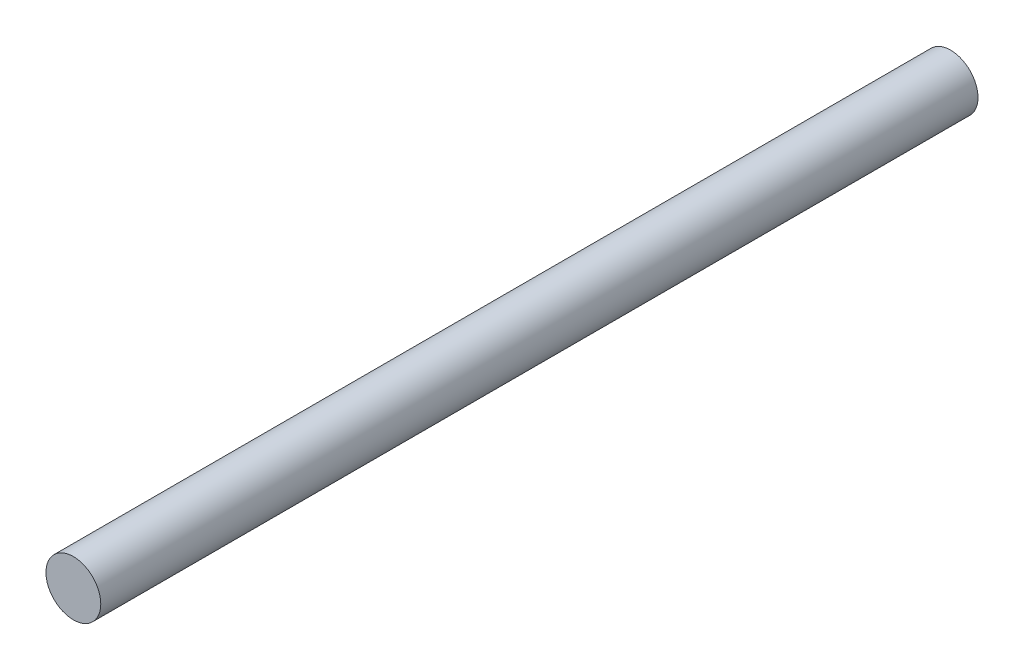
from build123d import *

# Parameters (mm, degrees)
BOSS_EXTRUDE1_DEPTH      = 50.8
BOSS_EXTRUDE1_DEPTH_BACK = 50.8
SKETCH1_R                = 3.175


with BuildPart() as part:
    # Sketch1 → Boss-Extrude1 (new, two sides: drawn at the far end of the back side and taken through both)
    with BuildSketch(Plane.XY.offset(-BOSS_EXTRUDE1_DEPTH_BACK)):
        Circle(SKETCH1_R)
    extrude(amount=BOSS_EXTRUDE1_DEPTH + BOSS_EXTRUDE1_DEPTH_BACK)


solid = part.part
